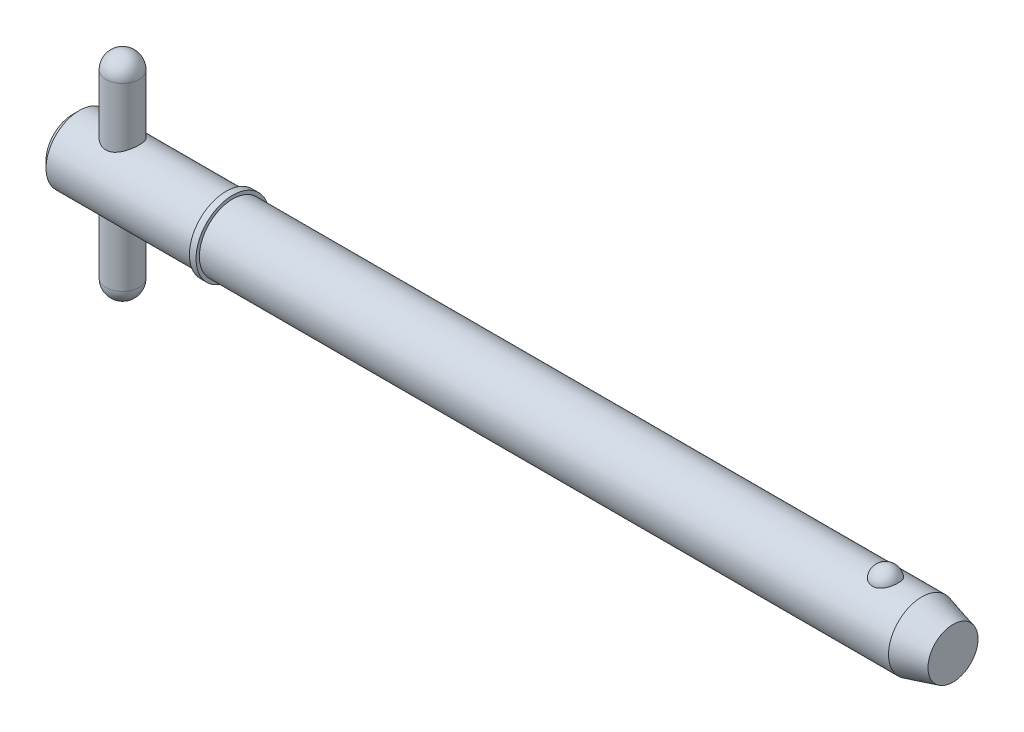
ISO-10303-21;
HEADER;
FILE_DESCRIPTION(('STEP AP214'),'2;1');
FILE_NAME('part.step','',(''),(''),'','','');
FILE_SCHEMA(('AUTOMOTIVE_DESIGN { 1 0 10303 214 1 1 1 1 }'));
ENDSEC;
DATA;
#1=APPLICATION_CONTEXT('core data for automotive mechanical design processes');
#2=APPLICATION_PROTOCOL_DEFINITION('international standard','automotive_design',2000,#1);
#3=PRODUCT_CONTEXT('',#1,'mechanical');
#4=PRODUCT('Part','Part','',(#3));
#5=PRODUCT_RELATED_PRODUCT_CATEGORY('part','',(#4));
#6=PRODUCT_DEFINITION_FORMATION('','',#4);
#7=PRODUCT_DEFINITION_CONTEXT('part definition',#1,'design');
#8=PRODUCT_DEFINITION('design','',#6,#7);
#9=PRODUCT_DEFINITION_SHAPE('','',#8);
#10=(LENGTH_UNIT() NAMED_UNIT(*) SI_UNIT(.MILLI.,.METRE.));
#11=(NAMED_UNIT(*) PLANE_ANGLE_UNIT() SI_UNIT($,.RADIAN.));
#12=(NAMED_UNIT(*) SI_UNIT($,.STERADIAN.) SOLID_ANGLE_UNIT());
#13=UNCERTAINTY_MEASURE_WITH_UNIT(LENGTH_MEASURE(1.E-05),#10,'distance_accuracy_value','');
#14=(GEOMETRIC_REPRESENTATION_CONTEXT(3) GLOBAL_UNCERTAINTY_ASSIGNED_CONTEXT((#13)) GLOBAL_UNIT_ASSIGNED_CONTEXT((#10,
#11,#12)) REPRESENTATION_CONTEXT('',''));
#15=CARTESIAN_POINT('',(0.,0.,0.));
#16=DIRECTION('',(0.,0.,1.));
#17=DIRECTION('',(1.,0.,0.));
#18=AXIS2_PLACEMENT_3D('',#15,#16,#17);
#19=CARTESIAN_POINT('',(5.94,12.7,0.));
#20=DIRECTION('',(0.,-1.,0.));
#21=DIRECTION('',(0.,0.,-1.));
#22=AXIS2_PLACEMENT_3D('',#19,#20,#21);
#23=CYLINDRICAL_SURFACE('',#22,1.98);
#24=CARTESIAN_POINT('',(5.94,-10.72,0.));
#25=DIRECTION('',(0.,-1.,0.));
#26=DIRECTION('',(0.,0.,-1.));
#27=AXIS2_PLACEMENT_3D('',#24,#25,#26);
#28=CIRCLE('',#27,1.98);
#29=CARTESIAN_POINT('',(5.94,-10.72,-1.98));
#30=VERTEX_POINT('',#29);
#31=EDGE_CURVE('P0_E10',#30,#30,#28,.F.);
#32=ORIENTED_EDGE('',*,*,#31,.T.);
#33=EDGE_LOOP('',(#32));
#34=FACE_BOUND('',#33,.T.);
#35=CARTESIAN_POINT('',(5.94,10.72,0.));
#36=DIRECTION('',(0.,-1.,0.));
#37=DIRECTION('',(0.,0.,-1.));
#38=AXIS2_PLACEMENT_3D('',#35,#36,#37);
#39=CIRCLE('',#38,1.98);
#40=CARTESIAN_POINT('',(5.94,10.72,-1.98));
#41=VERTEX_POINT('',#40);
#42=EDGE_CURVE('P0_E21',#41,#41,#39,.T.);
#43=ORIENTED_EDGE('',*,*,#42,.T.);
#44=EDGE_LOOP('',(#43));
#45=FACE_BOUND('',#44,.T.);
#46=ADVANCED_FACE('P0_F14',(#34,#45),#23,.T.);
#47=CARTESIAN_POINT('',(5.94,-10.72,0.));
#48=DIRECTION('',(0.,0.,1.));
#49=DIRECTION('',(1.,0.,0.));
#50=AXIS2_PLACEMENT_3D('',#47,#48,#49);
#51=SPHERICAL_SURFACE('',#50,1.98);
#52=CARTESIAN_POINT('',(5.94,-10.72,0.));
#53=DIRECTION('',(0.,-1.,0.));
#54=DIRECTION('',(0.,0.,-1.));
#55=AXIS2_PLACEMENT_3D('',#52,#53,#54);
#56=SPHERICAL_SURFACE('',#55,1.98);
#57=ORIENTED_EDGE('',*,*,#31,.F.);
#58=EDGE_LOOP('',(#57));
#59=FACE_BOUND('',#58,.T.);
#60=ADVANCED_FACE('P0_F29',(#59),#56,.T.);
#61=CARTESIAN_POINT('',(5.94,10.72,0.));
#62=DIRECTION('',(0.,0.,1.));
#63=DIRECTION('',(1.,0.,0.));
#64=AXIS2_PLACEMENT_3D('',#61,#62,#63);
#65=SPHERICAL_SURFACE('',#64,1.98);
#66=CARTESIAN_POINT('',(5.94,10.72,0.));
#67=DIRECTION('',(0.,-1.,0.));
#68=DIRECTION('',(0.,0.,-1.));
#69=AXIS2_PLACEMENT_3D('',#66,#67,#68);
#70=SPHERICAL_SURFACE('',#69,1.98);
#71=ORIENTED_EDGE('',*,*,#42,.F.);
#72=EDGE_LOOP('',(#71));
#73=FACE_BOUND('',#72,.T.);
#74=ADVANCED_FACE('P0_F16',(#73),#70,.T.);
#75=CLOSED_SHELL('',(#46,#60,#74));
#76=MANIFOLD_SOLID_BREP('P0_B1',#75);
#77=CARTESIAN_POINT('',(0.,0.,0.));
#78=DIRECTION('',(1.,0.,0.));
#79=DIRECTION('',(0.,0.,-1.));
#80=AXIS2_PLACEMENT_3D('',#77,#78,#79);
#81=CYLINDRICAL_SURFACE('',#80,3.97);
#82=CARTESIAN_POINT('',(101.075939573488,0.,0.));
#83=DIRECTION('',(1.,0.,0.));
#84=DIRECTION('',(0.,0.,-1.));
#85=AXIS2_PLACEMENT_3D('',#82,#83,#84);
#86=CIRCLE('',#85,3.97);
#87=CARTESIAN_POINT('',(101.075939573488,0.,-3.97));
#88=VERTEX_POINT('',#87);
#89=EDGE_CURVE('P1_E81',#88,#88,#86,.T.);
#90=ORIENTED_EDGE('',*,*,#89,.F.);
#91=EDGE_LOOP('',(#90));
#92=FACE_BOUND('',#91,.T.);
#93=CARTESIAN_POINT('',(19.05,0.,0.));
#94=DIRECTION('',(1.,0.,0.));
#95=DIRECTION('',(0.,0.,-1.));
#96=AXIS2_PLACEMENT_3D('',#93,#94,#95);
#97=CIRCLE('',#96,3.97);
#98=CARTESIAN_POINT('',(19.05,0.,-3.97));
#99=VERTEX_POINT('',#98);
#100=EDGE_CURVE('P1_E85',#99,#99,#97,.T.);
#101=ORIENTED_EDGE('',*,*,#100,.T.);
#102=EDGE_LOOP('',(#101));
#103=FACE_BOUND('',#102,.T.);
#104=CARTESIAN_POINT('',(96.7451922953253,3.65715365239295,1.5447094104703));
#105=CARTESIAN_POINT('',(96.6652448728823,3.65716001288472,1.54470290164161));
#106=CARTESIAN_POINT('',(96.5851650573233,3.65987074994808,1.53832549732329));
#107=CARTESIAN_POINT('',(96.4272374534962,3.6704221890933,1.51297018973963));
#108=CARTESIAN_POINT('',(96.3493961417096,3.67827646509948,1.49395894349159));
#109=CARTESIAN_POINT('',(96.1984614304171,3.69818848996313,1.44395950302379));
#110=CARTESIAN_POINT('',(96.1253560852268,3.71023513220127,1.41300293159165));
#111=CARTESIAN_POINT('',(95.9855630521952,3.7372183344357,1.34000212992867));
#112=CARTESIAN_POINT('',(95.9188725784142,3.75215363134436,1.29796274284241));
#113=CARTESIAN_POINT('',(95.7914886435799,3.78384968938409,1.20248834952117));
#114=CARTESIAN_POINT('',(95.7310299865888,3.80065129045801,1.14875388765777));
#115=CARTESIAN_POINT('',(95.6196942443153,3.83398532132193,1.03205417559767));
#116=CARTESIAN_POINT('',(95.5688200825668,3.85051766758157,0.969086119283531));
#117=CARTESIAN_POINT('',(95.4756321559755,3.88238608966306,0.832526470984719));
#118=CARTESIAN_POINT('',(95.4337961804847,3.89763698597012,0.75858832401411));
#119=CARTESIAN_POINT('',(95.3625108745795,3.92451063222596,0.604352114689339));
#120=CARTESIAN_POINT('',(95.3330623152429,3.93613315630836,0.524053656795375));
#121=CARTESIAN_POINT('',(95.2868927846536,3.95467606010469,0.35840348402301));
#122=CARTESIAN_POINT('',(95.2703127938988,3.96154426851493,0.273006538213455));
#123=CARTESIAN_POINT('',(95.250756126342,3.96967008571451,0.100408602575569));
#124=CARTESIAN_POINT('',(95.2477789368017,3.97092790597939,0.0132076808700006));
#125=CARTESIAN_POINT('',(95.2554587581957,3.96771794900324,-0.159844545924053));
#126=CARTESIAN_POINT('',(95.2660164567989,3.96329187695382,-0.245701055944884));
#127=CARTESIAN_POINT('',(95.3003800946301,3.94923163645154,-0.414277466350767));
#128=CARTESIAN_POINT('',(95.3241862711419,3.93959737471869,-0.49699731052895));
#129=CARTESIAN_POINT('',(95.3846114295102,3.91607752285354,-0.657113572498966));
#130=CARTESIAN_POINT('',(95.4212495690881,3.90218558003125,-0.734501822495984));
#131=CARTESIAN_POINT('',(95.5065935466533,3.87158287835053,-0.881704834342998));
#132=CARTESIAN_POINT('',(95.5553004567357,3.85487186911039,-0.951518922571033));
#133=CARTESIAN_POINT('',(95.6641161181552,3.82028735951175,-1.08208159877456));
#134=CARTESIAN_POINT('',(95.7242955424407,3.80240713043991,-1.14276958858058));
#135=CARTESIAN_POINT('',(95.854493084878,3.76758161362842,-1.25282437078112));
#136=CARTESIAN_POINT('',(95.9245105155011,3.75063626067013,-1.30219195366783));
#137=CARTESIAN_POINT('',(96.07118160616,3.71998948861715,-1.38729709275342));
#138=CARTESIAN_POINT('',(96.1476813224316,3.70623183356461,-1.42327904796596));
#139=CARTESIAN_POINT('',(96.3062981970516,3.68323188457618,-1.48178996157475));
#140=CARTESIAN_POINT('',(96.3884132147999,3.67398788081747,-1.50432401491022));
#141=CARTESIAN_POINT('',(96.5514810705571,3.66152163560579,-1.53440939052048));
#142=CARTESIAN_POINT('',(96.6322840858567,3.65801951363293,-1.54265826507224));
#143=CARTESIAN_POINT('',(96.7942085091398,3.65657341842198,-1.54608423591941));
#144=CARTESIAN_POINT('',(96.8753298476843,3.65862829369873,-1.5412640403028));
#145=CARTESIAN_POINT('',(97.0328122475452,3.66788969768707,-1.51908474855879));
#146=CARTESIAN_POINT('',(97.1092422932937,3.67492621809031,-1.50213925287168));
#147=CARTESIAN_POINT('',(97.2580412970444,3.69318404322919,-1.45666982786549));
#148=CARTESIAN_POINT('',(97.3304099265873,3.7044056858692,-1.42814496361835));
#149=CARTESIAN_POINT('',(97.4708029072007,3.73012749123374,-1.35956319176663));
#150=CARTESIAN_POINT('',(97.5387000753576,3.74469307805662,-1.31927107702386));
#151=CARTESIAN_POINT('',(97.6668649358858,3.77545272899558,-1.22847440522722));
#152=CARTESIAN_POINT('',(97.7271308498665,3.79164717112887,-1.17796747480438));
#153=CARTESIAN_POINT('',(97.8416346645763,3.82490325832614,-1.06519260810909));
#154=CARTESIAN_POINT('',(97.8954137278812,3.84196735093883,-1.00245914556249));
#155=CARTESIAN_POINT('',(97.9920988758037,3.87439863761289,-0.868715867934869));
#156=CARTESIAN_POINT('',(98.0350030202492,3.88976552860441,-0.797704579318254));
#157=CARTESIAN_POINT('',(98.110266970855,3.91771381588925,-0.64689620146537));
#158=CARTESIAN_POINT('',(98.1422532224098,3.93019255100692,-0.566893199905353));
#159=CARTESIAN_POINT('',(98.1931101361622,3.95043886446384,-0.402255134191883));
#160=CARTESIAN_POINT('',(98.2119807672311,3.95820643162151,-0.317620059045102));
#161=CARTESIAN_POINT('',(98.2362162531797,3.96823733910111,-0.146156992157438));
#162=CARTESIAN_POINT('',(98.2415874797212,3.970503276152,-0.0593300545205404));
#163=CARTESIAN_POINT('',(98.2387309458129,3.96930811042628,0.114057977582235));
#164=CARTESIAN_POINT('',(98.2305035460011,3.9658471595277,0.20061907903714));
#165=CARTESIAN_POINT('',(98.2007063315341,3.95358562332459,0.37050665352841));
#166=CARTESIAN_POINT('',(98.1792129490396,3.94481563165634,0.453848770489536));
#167=CARTESIAN_POINT('',(98.1233839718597,3.92284586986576,0.615497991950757));
#168=CARTESIAN_POINT('',(98.0890474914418,3.90964579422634,0.693804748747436));
#169=CARTESIAN_POINT('',(98.0079702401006,3.88006987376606,0.8437030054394));
#170=CARTESIAN_POINT('',(97.9611536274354,3.86367478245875,0.915249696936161));
#171=CARTESIAN_POINT('',(97.8561897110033,3.82949741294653,1.04910810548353));
#172=CARTESIAN_POINT('',(97.7980428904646,3.81171519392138,1.11142021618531));
#173=CARTESIAN_POINT('',(97.6717433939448,3.7767336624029,1.22503948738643));
#174=CARTESIAN_POINT('',(97.6035970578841,3.75953398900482,1.27635357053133));
#175=CARTESIAN_POINT('',(97.4589009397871,3.72770506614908,1.36653336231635));
#176=CARTESIAN_POINT('',(97.382348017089,3.7130767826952,1.4053943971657));
#177=CARTESIAN_POINT('',(97.2257594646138,3.68864287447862,1.46830480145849));
#178=CARTESIAN_POINT('',(97.1459307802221,3.67869017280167,1.49281289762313));
#179=CARTESIAN_POINT('',(96.9829877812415,3.66414535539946,1.52817474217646));
#180=CARTESIAN_POINT('',(96.8998840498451,3.65953723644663,1.53906926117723));
#181=CARTESIAN_POINT('',(96.7927760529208,3.6573894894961,1.54414878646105));
#182=CARTESIAN_POINT('',(96.7689900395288,3.65715175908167,1.54471134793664));
#183=CARTESIAN_POINT('',(96.7451922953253,3.65715365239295,1.5447094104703));
#184=B_SPLINE_CURVE_WITH_KNOTS('',3,(#104,#105,#106,#107,#108,#109,#110,#111,#112,#113,#114,
#115,#116,#117,#118,#119,#120,#121,#122,#123,#124,#125,#126,#127,#128,#129,#130,#131,#132,#133,
#134,#135,#136,#137,#138,#139,#140,#141,#142,#143,#144,#145,#146,#147,#148,#149,#150,#151,#152,
#153,#154,#155,#156,#157,#158,#159,#160,#161,#162,#163,#164,#165,#166,#167,#168,#169,#170,#171,
#172,#173,#174,#175,#176,#177,#178,#179,#180,#181,#182,#183),.UNSPECIFIED.,.T.,.F.,(4,2,2,2,2,2,
2,2,2,2,2,2,2,2,2,2,2,2,2,2,2,2,2,2,2,2,2,2,2,2,2,2,2,2,2,2,2,2,2,4),(0.,0.239777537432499,
0.48019041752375,0.719971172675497,0.959647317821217,1.20639040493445,1.45320863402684,
1.71093679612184,1.96868099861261,2.22921052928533,2.48973023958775,2.74834928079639,
3.00697295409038,3.26598440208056,3.52501886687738,3.78570385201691,4.04637062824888,
4.30201257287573,4.55755760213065,4.80022994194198,5.04285200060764,5.2775700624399,
5.51230707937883,5.75210128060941,5.99195126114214,6.24392810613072,6.49594987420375,
6.75588818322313,7.01582710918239,7.27564332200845,7.53545264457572,7.79377886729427,
8.05212290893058,8.31207418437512,8.57201437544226,8.83179046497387,9.09166393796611,
9.34270057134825,9.59298357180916,9.66435753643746),.UNSPECIFIED.);
#185=CARTESIAN_POINT('',(96.7451922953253,3.65715365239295,1.5447094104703));
#186=VERTEX_POINT('',#185);
#187=EDGE_CURVE('P1_E35',#186,#186,#184,.T.);
#188=ORIENTED_EDGE('',*,*,#187,.T.);
#189=EDGE_LOOP('',(#188));
#190=FACE_BOUND('',#189,.T.);
#191=ADVANCED_FACE('P1_F13',(#92,#103,#190),#81,.T.);
#192=CARTESIAN_POINT('',(0.,0.,0.));
#193=DIRECTION('',(-1.,0.,0.));
#194=DIRECTION('',(0.,0.,1.));
#195=AXIS2_PLACEMENT_3D('',#192,#193,#194);
#196=PLANE('',#195);
#197=CARTESIAN_POINT('',(0.,0.,0.));
#198=DIRECTION('',(1.,0.,0.));
#199=DIRECTION('',(0.,0.,-1.));
#200=AXIS2_PLACEMENT_3D('',#197,#198,#199);
#201=CIRCLE('',#200,3.176);
#202=CARTESIAN_POINT('',(0.,0.,-3.176));
#203=VERTEX_POINT('',#202);
#204=EDGE_CURVE('P1_E9',#203,#203,#201,.T.);
#205=ORIENTED_EDGE('',*,*,#204,.F.);
#206=EDGE_LOOP('',(#205));
#207=FACE_BOUND('',#206,.T.);
#208=ADVANCED_FACE('P1_F15',(#207),#196,.T.);
#209=CARTESIAN_POINT('',(0.793999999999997,0.,0.));
#210=DIRECTION('',(1.,0.,0.));
#211=DIRECTION('',(0.,0.,-1.));
#212=AXIS2_PLACEMENT_3D('',#209,#210,#211);
#213=CONICAL_SURFACE('',#212,3.97,0.78539816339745);
#214=ORIENTED_EDGE('',*,*,#204,.T.);
#215=EDGE_LOOP('',(#214));
#216=FACE_BOUND('',#215,.T.);
#217=CARTESIAN_POINT('',(0.793999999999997,0.,0.));
#218=DIRECTION('',(1.,0.,0.));
#219=DIRECTION('',(0.,0.,-1.));
#220=AXIS2_PLACEMENT_3D('',#217,#218,#219);
#221=CIRCLE('',#220,3.97);
#222=CARTESIAN_POINT('',(0.793999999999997,0.,-3.97));
#223=VERTEX_POINT('',#222);
#224=EDGE_CURVE('P1_E26',#223,#223,#221,.T.);
#225=ORIENTED_EDGE('',*,*,#224,.F.);
#226=EDGE_LOOP('',(#225));
#227=FACE_BOUND('',#226,.T.);
#228=ADVANCED_FACE('P1_F77',(#216,#227),#213,.T.);
#229=CARTESIAN_POINT('',(0.,0.,0.));
#230=DIRECTION('',(1.,0.,0.));
#231=DIRECTION('',(0.,0.,-1.));
#232=AXIS2_PLACEMENT_3D('',#229,#230,#231);
#233=CYLINDRICAL_SURFACE('',#232,3.97);
#234=CARTESIAN_POINT('',(5.94,-3.44100276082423,1.98));
#235=CARTESIAN_POINT('',(5.8367885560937,-3.44101282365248,1.97999171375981));
#236=CARTESIAN_POINT('',(5.73344176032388,-3.44571749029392,1.97187534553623));
#237=CARTESIAN_POINT('',(5.52991905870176,-3.46385873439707,1.93981946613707));
#238=CARTESIAN_POINT('',(5.42975031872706,-3.47731375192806,1.91584653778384));
#239=CARTESIAN_POINT('',(5.23590869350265,-3.51100678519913,1.85336773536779));
#240=CARTESIAN_POINT('',(5.14220446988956,-3.53120882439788,1.81493880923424));
#241=CARTESIAN_POINT('',(4.9625969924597,-3.57606420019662,1.72487335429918));
#242=CARTESIAN_POINT('',(4.87669412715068,-3.6007177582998,1.67323616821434));
#243=CARTESIAN_POINT('',(4.70734412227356,-3.65417020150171,1.55325205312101));
#244=CARTESIAN_POINT('',(4.62467662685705,-3.68314323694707,1.4838818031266));
#245=CARTESIAN_POINT('',(4.47154355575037,-3.74056406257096,1.33252902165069));
#246=CARTESIAN_POINT('',(4.40108404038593,-3.76901158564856,1.25054026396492));
#247=CARTESIAN_POINT('',(4.26974803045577,-3.82445556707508,1.06956584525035));
#248=CARTESIAN_POINT('',(4.20982960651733,-3.8512271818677,0.969809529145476));
#249=CARTESIAN_POINT('',(4.10798077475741,-3.89804342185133,0.760047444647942));
#250=CARTESIAN_POINT('',(4.06603907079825,-3.91809226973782,0.650048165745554));
#251=CARTESIAN_POINT('',(4.00441878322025,-3.94794912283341,0.431181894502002));
#252=CARTESIAN_POINT('',(3.98337329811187,-3.95838209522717,0.322786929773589));
#253=CARTESIAN_POINT('',(3.9596425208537,-3.97016407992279,0.103541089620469));
#254=CARTESIAN_POINT('',(3.95694618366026,-3.97151855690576,-0.00730826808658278));
#255=CARTESIAN_POINT('',(3.9694599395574,-3.96528826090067,-0.218044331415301));
#256=CARTESIAN_POINT('',(3.98314071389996,-3.95846689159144,-0.318049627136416));
#257=CARTESIAN_POINT('',(4.02528522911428,-3.93780347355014,-0.514124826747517));
#258=CARTESIAN_POINT('',(4.05375007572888,-3.92396089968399,-0.61019443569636));
#259=CARTESIAN_POINT('',(4.12484256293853,-3.89028355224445,-0.797351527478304));
#260=CARTESIAN_POINT('',(4.16766142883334,-3.87036821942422,-0.888351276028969));
#261=CARTESIAN_POINT('',(4.26598377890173,-3.82634285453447,-1.06209448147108));
#262=CARTESIAN_POINT('',(4.32149181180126,-3.8022313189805,-1.14483496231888));
#263=CARTESIAN_POINT('',(4.44962332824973,-3.74940011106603,-1.30802500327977));
#264=CARTESIAN_POINT('',(4.52336636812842,-3.72046031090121,-1.38752498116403));
#265=CARTESIAN_POINT('',(4.68287656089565,-3.66269463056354,-1.53354043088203));
#266=CARTESIAN_POINT('',(4.7686527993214,-3.63386885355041,-1.60004599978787));
#267=CARTESIAN_POINT('',(4.9564069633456,-3.57763161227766,-1.72228426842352));
#268=CARTESIAN_POINT('',(5.05906485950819,-3.5504233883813,-1.77707534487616));
#269=CARTESIAN_POINT('',(5.27381412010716,-3.50334038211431,-1.86819784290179));
#270=CARTESIAN_POINT('',(5.38589553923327,-3.48345798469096,-1.90454844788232));
#271=CARTESIAN_POINT('',(5.6069795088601,-3.45548331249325,-1.95481643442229));
#272=CARTESIAN_POINT('',(5.71552407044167,-3.44658268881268,-1.97028113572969));
#273=CARTESIAN_POINT('',(5.93399639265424,-3.43928114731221,-1.98300600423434));
#274=CARTESIAN_POINT('',(6.04392313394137,-3.44087289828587,-1.98027888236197));
#275=CARTESIAN_POINT('',(6.24931618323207,-3.45351901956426,-1.95811780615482));
#276=CARTESIAN_POINT('',(6.34505668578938,-3.46352725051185,-1.94052989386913));
#277=CARTESIAN_POINT('',(6.53204702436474,-3.49033612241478,-1.89188242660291));
#278=CARTESIAN_POINT('',(6.62329540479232,-3.50713894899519,-1.86081853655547));
#279=CARTESIAN_POINT('',(6.80352105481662,-3.54655680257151,-1.78458666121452));
#280=CARTESIAN_POINT('',(6.89219712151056,-3.56940508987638,-1.73883178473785));
#281=CARTESIAN_POINT('',(7.06112449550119,-3.61813012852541,-1.63502913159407));
#282=CARTESIAN_POINT('',(7.14137144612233,-3.6440084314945,-1.57697504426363));
#283=CARTESIAN_POINT('',(7.30168083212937,-3.69977514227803,-1.44171920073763));
#284=CARTESIAN_POINT('',(7.38046039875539,-3.7297597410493,-1.36302972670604));
#285=CARTESIAN_POINT('',(7.52409649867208,-3.78754991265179,-1.19307190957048));
#286=CARTESIAN_POINT('',(7.58894840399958,-3.81535475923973,-1.10179940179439));
#287=CARTESIAN_POINT('',(7.70430122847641,-3.86658972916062,-0.906019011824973));
#288=CARTESIAN_POINT('',(7.75438714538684,-3.88988795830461,-0.801229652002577));
#289=CARTESIAN_POINT('',(7.83572184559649,-3.92848199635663,-0.583216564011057));
#290=CARTESIAN_POINT('',(7.86698708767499,-3.94378479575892,-0.470000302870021));
#291=CARTESIAN_POINT('',(7.90711051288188,-3.96355307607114,-0.249525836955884));
#292=CARTESIAN_POINT('',(7.91775648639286,-3.96888171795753,-0.142669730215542));
#293=CARTESIAN_POINT('',(7.92160247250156,-3.97079858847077,0.0714191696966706));
#294=CARTESIAN_POINT('',(7.91480852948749,-3.96738984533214,0.178651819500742));
#295=CARTESIAN_POINT('',(7.88515479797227,-3.9527181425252,0.383072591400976));
#296=CARTESIAN_POINT('',(7.8633739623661,-3.94198303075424,0.480459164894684));
#297=CARTESIAN_POINT('',(7.80581513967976,-3.91422178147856,0.670038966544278));
#298=CARTESIAN_POINT('',(7.77003513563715,-3.89719473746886,0.762231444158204));
#299=CARTESIAN_POINT('',(7.68389191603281,-3.85747818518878,0.943248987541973));
#300=CARTESIAN_POINT('',(7.63296879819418,-3.83457704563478,1.03175978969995));
#301=CARTESIAN_POINT('',(7.51869140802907,-3.7855122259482,1.19934744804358));
#302=CARTESIAN_POINT('',(7.45533142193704,-3.75934704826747,1.2784199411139));
#303=CARTESIAN_POINT('',(7.31068939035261,-3.70329841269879,1.433144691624));
#304=CARTESIAN_POINT('',(7.22825362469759,-3.67330340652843,1.50768183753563));
#305=CARTESIAN_POINT('',(7.05162367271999,-3.61514025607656,1.64226879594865));
#306=CARTESIAN_POINT('',(6.95741928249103,-3.58697372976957,1.70230590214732));
#307=CARTESIAN_POINT('',(6.75590859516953,-3.53504049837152,1.80775364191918));
#308=CARTESIAN_POINT('',(6.64828786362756,-3.51143624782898,1.85265616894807));
#309=CARTESIAN_POINT('',(6.48137774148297,-3.48289659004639,1.90544537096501));
#310=CARTESIAN_POINT('',(6.42488151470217,-3.4745323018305,1.9206071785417));
#311=CARTESIAN_POINT('',(6.31046920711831,-3.4604244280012,1.94591259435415));
#312=CARTESIAN_POINT('',(6.25255415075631,-3.45467900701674,1.95605971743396));
#313=CARTESIAN_POINT('',(6.1521444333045,-3.44728060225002,1.96905939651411));
#314=CARTESIAN_POINT('',(6.10985721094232,-3.44493297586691,1.97315742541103));
#315=CARTESIAN_POINT('',(6.02505433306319,-3.44179192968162,1.97862952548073));
#316=CARTESIAN_POINT('',(5.98253866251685,-3.44099861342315,1.98000341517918));
#317=CARTESIAN_POINT('',(5.94,-3.44100276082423,1.98));
#318=B_SPLINE_CURVE_WITH_KNOTS('',3,(#234,#235,#236,#237,#238,#239,#240,#241,#242,#243,#244,
#245,#246,#247,#248,#249,#250,#251,#252,#253,#254,#255,#256,#257,#258,#259,#260,#261,#262,#263,
#264,#265,#266,#267,#268,#269,#270,#271,#272,#273,#274,#275,#276,#277,#278,#279,#280,#281,#282,
#283,#284,#285,#286,#287,#288,#289,#290,#291,#292,#293,#294,#295,#296,#297,#298,#299,#300,#301,
#302,#303,#304,#305,#306,#307,#308,#309,#310,#311,#312,#313,#314,#315,#316,#317),.UNSPECIFIED.,
.T.,.F.,(4,2,2,2,2,2,2,2,2,2,2,2,2,2,2,2,2,2,2,2,2,2,2,2,2,2,2,2,2,2,2,2,2,2,2,2,2,2,2,2,2,4),
(0.,0.309462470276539,0.619579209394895,0.928068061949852,1.23657226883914,1.57038619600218,
1.90436536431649,2.26071614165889,2.61684266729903,2.94773555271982,3.27842924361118,
3.58050679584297,3.88260694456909,4.18890317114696,4.49530936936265,4.83057163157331,
5.1660884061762,5.52272472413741,5.87898927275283,6.20706708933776,6.53491569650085,
6.82716910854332,7.11951660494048,7.42541184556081,7.73146442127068,8.07586334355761,
8.42037652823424,8.77380887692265,9.12693169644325,9.44775848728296,9.76847409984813,
10.0682302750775,10.3680296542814,10.6806938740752,10.9935020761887,11.3373031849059,
11.6814044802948,12.0361164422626,12.2131519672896,12.3900632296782,12.5175998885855,
12.6451450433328),.UNSPECIFIED.);
#319=CARTESIAN_POINT('',(5.94,-3.44100276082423,1.98));
#320=VERTEX_POINT('',#319);
#321=EDGE_CURVE('P1_E17',#320,#320,#318,.T.);
#322=ORIENTED_EDGE('',*,*,#321,.F.);
#323=EDGE_LOOP('',(#322));
#324=FACE_BOUND('',#323,.T.);
#325=CARTESIAN_POINT('',(5.94,3.44100276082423,1.98));
#326=CARTESIAN_POINT('',(6.0432114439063,3.44101282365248,1.97999171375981));
#327=CARTESIAN_POINT('',(6.14655823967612,3.44571749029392,1.97187534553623));
#328=CARTESIAN_POINT('',(6.35008094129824,3.46385873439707,1.93981946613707));
#329=CARTESIAN_POINT('',(6.45024968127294,3.47731375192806,1.91584653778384));
#330=CARTESIAN_POINT('',(6.64409130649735,3.51100678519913,1.85336773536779));
#331=CARTESIAN_POINT('',(6.73779553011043,3.53120882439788,1.81493880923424));
#332=CARTESIAN_POINT('',(6.91740300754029,3.57606420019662,1.72487335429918));
#333=CARTESIAN_POINT('',(7.00330587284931,3.6007177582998,1.67323616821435));
#334=CARTESIAN_POINT('',(7.17265587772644,3.65417020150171,1.55325205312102));
#335=CARTESIAN_POINT('',(7.25532337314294,3.68314323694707,1.4838818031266));
#336=CARTESIAN_POINT('',(7.40845644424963,3.74056406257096,1.3325290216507));
#337=CARTESIAN_POINT('',(7.47891595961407,3.76901158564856,1.25054026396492));
#338=CARTESIAN_POINT('',(7.61025196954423,3.82445556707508,1.06956584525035));
#339=CARTESIAN_POINT('',(7.67017039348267,3.8512271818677,0.969809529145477));
#340=CARTESIAN_POINT('',(7.77201922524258,3.89804342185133,0.760047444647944));
#341=CARTESIAN_POINT('',(7.81396092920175,3.91809226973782,0.650048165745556));
#342=CARTESIAN_POINT('',(7.87558121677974,3.94794912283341,0.431181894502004));
#343=CARTESIAN_POINT('',(7.89662670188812,3.95838209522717,0.322786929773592));
#344=CARTESIAN_POINT('',(7.9203574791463,3.97016407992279,0.103541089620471));
#345=CARTESIAN_POINT('',(7.92305381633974,3.97151855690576,-0.00730826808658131));
#346=CARTESIAN_POINT('',(7.9105400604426,3.96528826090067,-0.2180443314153));
#347=CARTESIAN_POINT('',(7.89685928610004,3.95846689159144,-0.318049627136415));
#348=CARTESIAN_POINT('',(7.85471477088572,3.93780347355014,-0.514124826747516));
#349=CARTESIAN_POINT('',(7.82624992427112,3.92396089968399,-0.61019443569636));
#350=CARTESIAN_POINT('',(7.75515743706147,3.89028355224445,-0.797351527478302));
#351=CARTESIAN_POINT('',(7.71233857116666,3.87036821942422,-0.888351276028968));
#352=CARTESIAN_POINT('',(7.61401622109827,3.82634285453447,-1.06209448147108));
#353=CARTESIAN_POINT('',(7.55850818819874,3.8022313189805,-1.14483496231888));
#354=CARTESIAN_POINT('',(7.43037667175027,3.74940011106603,-1.30802500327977));
#355=CARTESIAN_POINT('',(7.35663363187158,3.72046031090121,-1.38752498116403));
#356=CARTESIAN_POINT('',(7.19712343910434,3.66269463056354,-1.53354043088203));
#357=CARTESIAN_POINT('',(7.1113472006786,3.63386885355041,-1.60004599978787));
#358=CARTESIAN_POINT('',(6.9235930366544,3.57763161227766,-1.72228426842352));
#359=CARTESIAN_POINT('',(6.82093514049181,3.5504233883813,-1.77707534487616));
#360=CARTESIAN_POINT('',(6.60618587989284,3.50334038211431,-1.86819784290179));
#361=CARTESIAN_POINT('',(6.49410446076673,3.48345798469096,-1.90454844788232));
#362=CARTESIAN_POINT('',(6.2730204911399,3.45548331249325,-1.95481643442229));
#363=CARTESIAN_POINT('',(6.16447592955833,3.44658268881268,-1.97028113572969));
#364=CARTESIAN_POINT('',(5.94600360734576,3.43928114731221,-1.98300600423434));
#365=CARTESIAN_POINT('',(5.83607686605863,3.44087289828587,-1.98027888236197));
#366=CARTESIAN_POINT('',(5.63068381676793,3.45351901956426,-1.95811780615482));
#367=CARTESIAN_POINT('',(5.53494331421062,3.46352725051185,-1.94052989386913));
#368=CARTESIAN_POINT('',(5.34795297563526,3.49033612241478,-1.89188242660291));
#369=CARTESIAN_POINT('',(5.25670459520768,3.50713894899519,-1.86081853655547));
#370=CARTESIAN_POINT('',(5.07647894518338,3.54655680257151,-1.78458666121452));
#371=CARTESIAN_POINT('',(4.98780287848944,3.56940508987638,-1.73883178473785));
#372=CARTESIAN_POINT('',(4.81887550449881,3.61813012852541,-1.63502913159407));
#373=CARTESIAN_POINT('',(4.73862855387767,3.6440084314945,-1.57697504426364));
#374=CARTESIAN_POINT('',(4.57831916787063,3.69977514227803,-1.44171920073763));
#375=CARTESIAN_POINT('',(4.49953960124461,3.7297597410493,-1.36302972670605));
#376=CARTESIAN_POINT('',(4.35590350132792,3.78754991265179,-1.19307190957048));
#377=CARTESIAN_POINT('',(4.29105159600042,3.81535475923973,-1.10179940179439));
#378=CARTESIAN_POINT('',(4.17569877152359,3.86658972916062,-0.906019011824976));
#379=CARTESIAN_POINT('',(4.12561285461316,3.88988795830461,-0.80122965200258));
#380=CARTESIAN_POINT('',(4.04427815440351,3.92848199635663,-0.58321656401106));
#381=CARTESIAN_POINT('',(4.01301291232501,3.94378479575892,-0.470000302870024));
#382=CARTESIAN_POINT('',(3.97288948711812,3.96355307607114,-0.249525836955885));
#383=CARTESIAN_POINT('',(3.96224351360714,3.96888171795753,-0.142669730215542));
#384=CARTESIAN_POINT('',(3.95839752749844,3.97079858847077,0.0714191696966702));
#385=CARTESIAN_POINT('',(3.96519147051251,3.96738984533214,0.178651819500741));
#386=CARTESIAN_POINT('',(3.99484520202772,3.9527181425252,0.383072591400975));
#387=CARTESIAN_POINT('',(4.01662603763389,3.94198303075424,0.480459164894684));
#388=CARTESIAN_POINT('',(4.07418486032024,3.91422178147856,0.670038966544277));
#389=CARTESIAN_POINT('',(4.10996486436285,3.89719473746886,0.762231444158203));
#390=CARTESIAN_POINT('',(4.19610808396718,3.85747818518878,0.943248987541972));
#391=CARTESIAN_POINT('',(4.24703120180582,3.83457704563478,1.03175978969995));
#392=CARTESIAN_POINT('',(4.36130859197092,3.7855122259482,1.19934744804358));
#393=CARTESIAN_POINT('',(4.42466857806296,3.75934704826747,1.2784199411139));
#394=CARTESIAN_POINT('',(4.56931060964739,3.70329841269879,1.433144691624));
#395=CARTESIAN_POINT('',(4.65174637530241,3.67330340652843,1.50768183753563));
#396=CARTESIAN_POINT('',(4.82837632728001,3.61514025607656,1.64226879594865));
#397=CARTESIAN_POINT('',(4.92258071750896,3.58697372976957,1.70230590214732));
#398=CARTESIAN_POINT('',(5.12409140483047,3.53504049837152,1.80775364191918));
#399=CARTESIAN_POINT('',(5.23171213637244,3.51143624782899,1.85265616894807));
#400=CARTESIAN_POINT('',(5.39862225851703,3.48289659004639,1.90544537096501));
#401=CARTESIAN_POINT('',(5.45511848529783,3.4745323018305,1.9206071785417));
#402=CARTESIAN_POINT('',(5.56953079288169,3.4604244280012,1.94591259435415));
#403=CARTESIAN_POINT('',(5.62744584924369,3.45467900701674,1.95605971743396));
#404=CARTESIAN_POINT('',(5.7278555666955,3.44728060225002,1.9690593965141));
#405=CARTESIAN_POINT('',(5.77014278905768,3.44493297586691,1.97315742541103));
#406=CARTESIAN_POINT('',(5.85494566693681,3.44179192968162,1.97862952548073));
#407=CARTESIAN_POINT('',(5.89746133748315,3.44099861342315,1.98000341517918));
#408=CARTESIAN_POINT('',(5.94,3.44100276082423,1.98));
#409=B_SPLINE_CURVE_WITH_KNOTS('',3,(#325,#326,#327,#328,#329,#330,#331,#332,#333,#334,#335,
#336,#337,#338,#339,#340,#341,#342,#343,#344,#345,#346,#347,#348,#349,#350,#351,#352,#353,#354,
#355,#356,#357,#358,#359,#360,#361,#362,#363,#364,#365,#366,#367,#368,#369,#370,#371,#372,#373,
#374,#375,#376,#377,#378,#379,#380,#381,#382,#383,#384,#385,#386,#387,#388,#389,#390,#391,#392,
#393,#394,#395,#396,#397,#398,#399,#400,#401,#402,#403,#404,#405,#406,#407,#408),.UNSPECIFIED.,
.T.,.F.,(4,2,2,2,2,2,2,2,2,2,2,2,2,2,2,2,2,2,2,2,2,2,2,2,2,2,2,2,2,2,2,2,2,2,2,2,2,2,2,2,2,4),
(0.,0.309462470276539,0.619579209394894,0.928068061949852,1.23657226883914,1.57038619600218,
1.90436536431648,2.26071614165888,2.61684266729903,2.94773555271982,3.27842924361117,
3.58050679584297,3.88260694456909,4.18890317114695,4.49530936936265,4.83057163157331,
5.1660884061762,5.5227247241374,5.87898927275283,6.20706708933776,6.53491569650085,
6.82716910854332,7.11951660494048,7.42541184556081,7.73146442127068,8.07586334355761,
8.42037652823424,8.77380887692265,9.12693169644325,9.44775848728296,9.76847409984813,
10.0682302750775,10.3680296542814,10.6806938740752,10.9935020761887,11.3373031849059,
11.6814044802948,12.0361164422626,12.2131519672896,12.3900632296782,12.5175998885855,
12.6451450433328),.UNSPECIFIED.);
#410=CARTESIAN_POINT('',(5.94,3.44100276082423,1.98));
#411=VERTEX_POINT('',#410);
#412=EDGE_CURVE('P1_E43',#411,#411,#409,.T.);
#413=ORIENTED_EDGE('',*,*,#412,.F.);
#414=EDGE_LOOP('',(#413));
#415=FACE_BOUND('',#414,.T.);
#416=ORIENTED_EDGE('',*,*,#224,.T.);
#417=EDGE_LOOP('',(#416));
#418=FACE_BOUND('',#417,.T.);
#419=CARTESIAN_POINT('',(18.256,0.,0.));
#420=DIRECTION('',(1.,0.,0.));
#421=DIRECTION('',(0.,0.,-1.));
#422=AXIS2_PLACEMENT_3D('',#419,#420,#421);
#423=CIRCLE('',#422,3.97);
#424=CARTESIAN_POINT('',(18.256,0.,-3.97));
#425=VERTEX_POINT('',#424);
#426=EDGE_CURVE('P1_E31',#425,#425,#423,.T.);
#427=ORIENTED_EDGE('',*,*,#426,.F.);
#428=EDGE_LOOP('',(#427));
#429=FACE_BOUND('',#428,.T.);
#430=ADVANCED_FACE('P1_F103',(#324,#415,#418,#429),#233,.T.);
#431=CARTESIAN_POINT('',(18.256,3.97,0.));
#432=DIRECTION('',(-1.,0.,0.));
#433=DIRECTION('',(0.,0.,1.));
#434=AXIS2_PLACEMENT_3D('',#431,#432,#433);
#435=PLANE('',#434);
#436=ORIENTED_EDGE('',*,*,#426,.T.);
#437=EDGE_LOOP('',(#436));
#438=FACE_BOUND('',#437,.T.);
#439=CARTESIAN_POINT('',(18.256,0.,0.));
#440=DIRECTION('',(1.,0.,0.));
#441=DIRECTION('',(0.,0.,-1.));
#442=AXIS2_PLACEMENT_3D('',#439,#440,#441);
#443=CIRCLE('',#442,4.367);
#444=CARTESIAN_POINT('',(18.256,0.,-4.367));
#445=VERTEX_POINT('',#444);
#446=EDGE_CURVE('P1_E91',#445,#445,#443,.T.);
#447=ORIENTED_EDGE('',*,*,#446,.F.);
#448=EDGE_LOOP('',(#447));
#449=FACE_BOUND('',#448,.T.);
#450=ADVANCED_FACE('P1_F100',(#438,#449),#435,.T.);
#451=CARTESIAN_POINT('',(0.,0.,0.));
#452=DIRECTION('',(1.,0.,0.));
#453=DIRECTION('',(0.,0.,-1.));
#454=AXIS2_PLACEMENT_3D('',#451,#452,#453);
#455=CYLINDRICAL_SURFACE('',#454,4.367);
#456=ORIENTED_EDGE('',*,*,#446,.T.);
#457=EDGE_LOOP('',(#456));
#458=FACE_BOUND('',#457,.T.);
#459=CARTESIAN_POINT('',(19.05,0.,0.));
#460=DIRECTION('',(1.,0.,0.));
#461=DIRECTION('',(0.,0.,-1.));
#462=AXIS2_PLACEMENT_3D('',#459,#460,#461);
#463=CIRCLE('',#462,4.367);
#464=CARTESIAN_POINT('',(19.05,0.,-4.367));
#465=VERTEX_POINT('',#464);
#466=EDGE_CURVE('P1_E88',#465,#465,#463,.T.);
#467=ORIENTED_EDGE('',*,*,#466,.F.);
#468=EDGE_LOOP('',(#467));
#469=FACE_BOUND('',#468,.T.);
#470=ADVANCED_FACE('P1_F68',(#458,#469),#455,.T.);
#471=CARTESIAN_POINT('',(19.05,4.367,0.));
#472=DIRECTION('',(1.,0.,0.));
#473=DIRECTION('',(0.,0.,-1.));
#474=AXIS2_PLACEMENT_3D('',#471,#472,#473);
#475=PLANE('',#474);
#476=ORIENTED_EDGE('',*,*,#466,.T.);
#477=EDGE_LOOP('',(#476));
#478=FACE_BOUND('',#477,.T.);
#479=ORIENTED_EDGE('',*,*,#100,.F.);
#480=EDGE_LOOP('',(#479));
#481=FACE_BOUND('',#480,.T.);
#482=ADVANCED_FACE('P1_F62',(#478,#481),#475,.T.);
#483=CARTESIAN_POINT('',(104.78,0.,0.));
#484=DIRECTION('',(-1.,0.,0.));
#485=DIRECTION('',(0.,0.,1.));
#486=AXIS2_PLACEMENT_3D('',#483,#484,#485);
#487=CONICAL_SURFACE('',#486,2.97750000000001,0.26179938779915);
#488=ORIENTED_EDGE('',*,*,#89,.T.);
#489=EDGE_LOOP('',(#488));
#490=FACE_BOUND('',#489,.T.);
#491=CARTESIAN_POINT('',(104.78,0.,0.));
#492=DIRECTION('',(1.,0.,0.));
#493=DIRECTION('',(0.,0.,-1.));
#494=AXIS2_PLACEMENT_3D('',#491,#492,#493);
#495=CIRCLE('',#494,2.97750000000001);
#496=CARTESIAN_POINT('',(104.78,0.,-2.97750000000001));
#497=VERTEX_POINT('',#496);
#498=EDGE_CURVE('P1_E42',#497,#497,#495,.T.);
#499=ORIENTED_EDGE('',*,*,#498,.F.);
#500=EDGE_LOOP('',(#499));
#501=FACE_BOUND('',#500,.T.);
#502=ADVANCED_FACE('P1_F59',(#490,#501),#487,.T.);
#503=CARTESIAN_POINT('',(104.78,2.97750000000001,0.));
#504=DIRECTION('',(1.,0.,0.));
#505=DIRECTION('',(0.,0.,-1.));
#506=AXIS2_PLACEMENT_3D('',#503,#504,#505);
#507=PLANE('',#506);
#508=ORIENTED_EDGE('',*,*,#498,.T.);
#509=EDGE_LOOP('',(#508));
#510=FACE_BOUND('',#509,.T.);
#511=ADVANCED_FACE('P1_F55',(#510),#507,.T.);
#512=CARTESIAN_POINT('',(96.7451922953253,3.573,0.));
#513=DIRECTION('',(-1.,0.,0.));
#514=DIRECTION('',(0.,1.,0.));
#515=AXIS2_PLACEMENT_3D('',#512,#513,#514);
#516=SPHERICAL_SURFACE('',#515,1.54700000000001);
#517=ORIENTED_EDGE('',*,*,#187,.F.);
#518=EDGE_LOOP('',(#517));
#519=FACE_BOUND('',#518,.T.);
#520=ADVANCED_FACE('P1_F50',(#519),#516,.T.);
#521=CARTESIAN_POINT('',(5.94,-4.367,0.));
#522=DIRECTION('',(0.,1.,0.));
#523=DIRECTION('',(0.,0.,1.));
#524=AXIS2_PLACEMENT_3D('',#521,#522,#523);
#525=CYLINDRICAL_SURFACE('',#524,1.98);
#526=ORIENTED_EDGE('',*,*,#321,.T.);
#527=EDGE_LOOP('',(#526));
#528=FACE_BOUND('',#527,.T.);
#529=ORIENTED_EDGE('',*,*,#412,.T.);
#530=EDGE_LOOP('',(#529));
#531=FACE_BOUND('',#530,.T.);
#532=ADVANCED_FACE('P1_F54',(#528,#531),#525,.F.);
#533=CLOSED_SHELL('',(#191,#208,#228,#430,#450,#470,#482,#502,#511,#520,#532));
#534=MANIFOLD_SOLID_BREP('P1_B1',#533);
#535=ADVANCED_BREP_SHAPE_REPRESENTATION('',(#18,#76,#534),#14);
#536=SHAPE_DEFINITION_REPRESENTATION(#9,#535);
ENDSEC;
END-ISO-10303-21;
